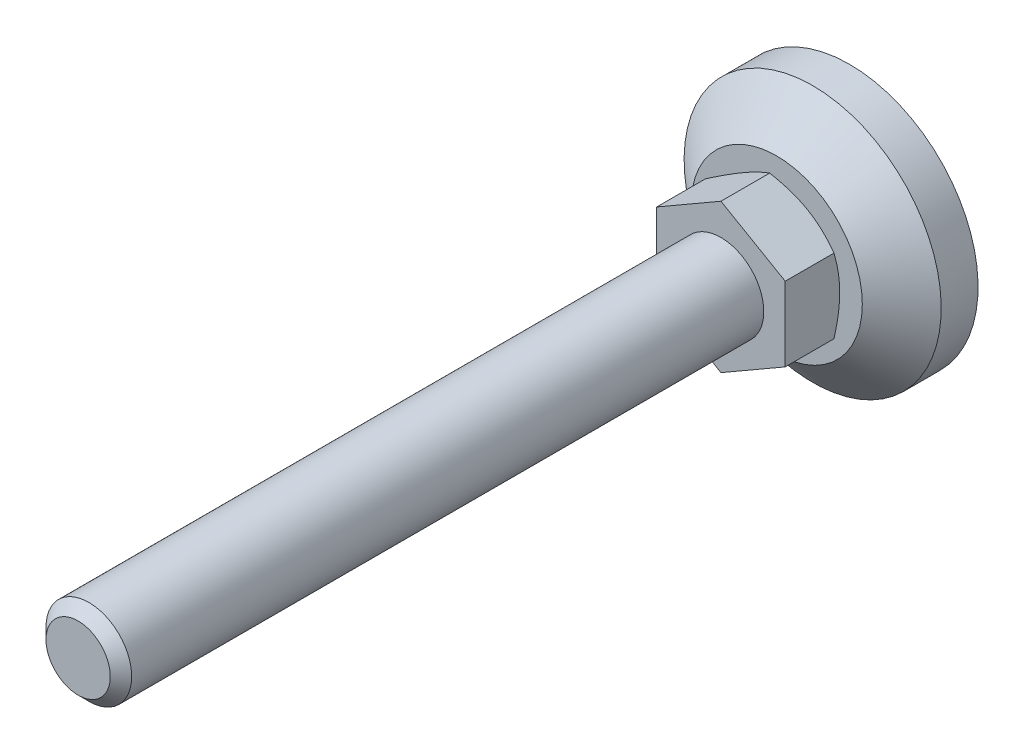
ISO-10303-21;
HEADER;
FILE_DESCRIPTION(('STEP AP214'),'2;1');
FILE_NAME('part.step','',(''),(''),'','','');
FILE_SCHEMA(('AUTOMOTIVE_DESIGN { 1 0 10303 214 1 1 1 1 }'));
ENDSEC;
DATA;
#1=APPLICATION_CONTEXT('core data for automotive mechanical design processes');
#2=APPLICATION_PROTOCOL_DEFINITION('international standard','automotive_design',2000,#1);
#3=PRODUCT_CONTEXT('',#1,'mechanical');
#4=PRODUCT('Part','Part','',(#3));
#5=PRODUCT_RELATED_PRODUCT_CATEGORY('part','',(#4));
#6=PRODUCT_DEFINITION_FORMATION('','',#4);
#7=PRODUCT_DEFINITION_CONTEXT('part definition',#1,'design');
#8=PRODUCT_DEFINITION('design','',#6,#7);
#9=PRODUCT_DEFINITION_SHAPE('','',#8);
#10=(LENGTH_UNIT() NAMED_UNIT(*) SI_UNIT(.MILLI.,.METRE.));
#11=(NAMED_UNIT(*) PLANE_ANGLE_UNIT() SI_UNIT($,.RADIAN.));
#12=(NAMED_UNIT(*) SI_UNIT($,.STERADIAN.) SOLID_ANGLE_UNIT());
#13=UNCERTAINTY_MEASURE_WITH_UNIT(LENGTH_MEASURE(1.E-05),#10,'distance_accuracy_value','');
#14=(GEOMETRIC_REPRESENTATION_CONTEXT(3) GLOBAL_UNCERTAINTY_ASSIGNED_CONTEXT((#13)) GLOBAL_UNIT_ASSIGNED_CONTEXT((#10,
#11,#12)) REPRESENTATION_CONTEXT('',''));
#15=CARTESIAN_POINT('',(0.,0.,0.));
#16=DIRECTION('',(0.,0.,1.));
#17=DIRECTION('',(1.,0.,0.));
#18=AXIS2_PLACEMENT_3D('',#15,#16,#17);
#19=CARTESIAN_POINT('',(0.,0.,30.));
#20=DIRECTION('',(0.,0.,1.));
#21=DIRECTION('',(0.5,-0.86602540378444,0.));
#22=AXIS2_PLACEMENT_3D('',#19,#20,#21);
#23=PLANE('',#22);
#24=DIRECTION('',(0.,1.,0.));
#25=VECTOR('',#24,1.);
#26=CARTESIAN_POINT('',(15.,-8.66025403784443,30.));
#27=LINE('',#26,#25);
#28=CARTESIAN_POINT('',(15.,-8.66025403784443,30.));
#29=VERTEX_POINT('',#28);
#30=CARTESIAN_POINT('',(15.,8.66025403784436,30.));
#31=VERTEX_POINT('',#30);
#32=EDGE_CURVE('E197',#29,#31,#27,.T.);
#33=ORIENTED_EDGE('',*,*,#32,.T.);
#34=DIRECTION('',(-0.866025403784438,0.5,0.));
#35=VECTOR('',#34,1.);
#36=CARTESIAN_POINT('',(15.,8.66025403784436,30.));
#37=LINE('',#36,#35);
#38=CARTESIAN_POINT('',(0.,17.3205080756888,30.));
#39=VERTEX_POINT('',#38);
#40=EDGE_CURVE('E320',#31,#39,#37,.T.);
#41=ORIENTED_EDGE('',*,*,#40,.T.);
#42=DIRECTION('',(-0.86602540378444,-0.5,0.));
#43=VECTOR('',#42,1.);
#44=CARTESIAN_POINT('',(0.,17.3205080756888,30.));
#45=LINE('',#44,#43);
#46=CARTESIAN_POINT('',(-15.,8.66025403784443,30.));
#47=VERTEX_POINT('',#46);
#48=EDGE_CURVE('E319',#39,#47,#45,.T.);
#49=ORIENTED_EDGE('',*,*,#48,.T.);
#50=DIRECTION('',(0.,-1.,0.));
#51=VECTOR('',#50,1.);
#52=CARTESIAN_POINT('',(-15.,8.66025403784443,30.));
#53=LINE('',#52,#51);
#54=CARTESIAN_POINT('',(-15.,-8.66025403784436,30.));
#55=VERTEX_POINT('',#54);
#56=EDGE_CURVE('E324',#47,#55,#53,.T.);
#57=ORIENTED_EDGE('',*,*,#56,.T.);
#58=DIRECTION('',(0.866025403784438,-0.5,0.));
#59=VECTOR('',#58,1.);
#60=CARTESIAN_POINT('',(-15.,-8.66025403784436,30.));
#61=LINE('',#60,#59);
#62=CARTESIAN_POINT('',(0.,-17.3205080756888,30.));
#63=VERTEX_POINT('',#62);
#64=EDGE_CURVE('E326',#55,#63,#61,.T.);
#65=ORIENTED_EDGE('',*,*,#64,.T.);
#66=DIRECTION('',(0.86602540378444,0.5,0.));
#67=VECTOR('',#66,1.);
#68=CARTESIAN_POINT('',(0.,-17.3205080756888,30.));
#69=LINE('',#68,#67);
#70=EDGE_CURVE('E37',#63,#29,#69,.T.);
#71=ORIENTED_EDGE('',*,*,#70,.T.);
#72=EDGE_LOOP('',(#33,#41,#49,#57,#65,#71));
#73=FACE_BOUND('',#72,.T.);
#74=CARTESIAN_POINT('',(0.,0.,30.));
#75=DIRECTION('',(0.,0.,1.));
#76=DIRECTION('',(0.5,-0.86602540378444,0.));
#77=AXIS2_PLACEMENT_3D('',#74,#75,#76);
#78=CIRCLE('',#77,10.);
#79=CARTESIAN_POINT('',(5.,-8.6602540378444,30.));
#80=VERTEX_POINT('',#79);
#81=EDGE_CURVE('E201',#80,#80,#78,.T.);
#82=ORIENTED_EDGE('',*,*,#81,.F.);
#83=EDGE_LOOP('',(#82));
#84=FACE_BOUND('',#83,.T.);
#85=ADVANCED_FACE('F14',(#73,#84),#23,.T.);
#86=CARTESIAN_POINT('',(-9.9946349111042,17.3112154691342,17.));
#87=DIRECTION('',(0.,0.,1.));
#88=DIRECTION('',(0.5,-0.86602540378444,0.));
#89=AXIS2_PLACEMENT_3D('',#86,#87,#88);
#90=PLANE('',#89);
#91=CARTESIAN_POINT('',(0.,0.,17.));
#92=DIRECTION('',(0.,0.,-1.));
#93=DIRECTION('',(-0.5,0.86602540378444,0.));
#94=AXIS2_PLACEMENT_3D('',#91,#92,#93);
#95=CIRCLE('',#94,19.9892698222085);
#96=CARTESIAN_POINT('',(-9.99463491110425,17.3112154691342,17.));
#97=VERTEX_POINT('',#96);
#98=EDGE_CURVE('E102',#97,#97,#95,.T.);
#99=ORIENTED_EDGE('',*,*,#98,.F.);
#100=EDGE_LOOP('',(#99));
#101=FACE_BOUND('',#100,.T.);
#102=CARTESIAN_POINT('',(0.,0.,17.));
#103=DIRECTION('',(0.,0.,-1.));
#104=DIRECTION('',(-0.5,0.86602540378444,0.));
#105=AXIS2_PLACEMENT_3D('',#102,#103,#104);
#106=CIRCLE('',#105,14.5);
#107=CARTESIAN_POINT('',(-7.25,12.5573683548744,17.));
#108=VERTEX_POINT('',#107);
#109=EDGE_CURVE('E84',#108,#108,#106,.T.);
#110=ORIENTED_EDGE('',*,*,#109,.T.);
#111=EDGE_LOOP('',(#110));
#112=FACE_BOUND('',#111,.T.);
#113=ADVANCED_FACE('F174',(#101,#112),#90,.T.);
#114=CARTESIAN_POINT('',(0.,0.,0.));
#115=DIRECTION('',(0.,0.,-1.));
#116=DIRECTION('',(-0.5,0.86602540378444,0.));
#117=AXIS2_PLACEMENT_3D('',#114,#115,#116);
#118=PLANE('',#117);
#119=CARTESIAN_POINT('',(0.,0.,0.));
#120=DIRECTION('',(0.,0.,-1.));
#121=DIRECTION('',(-0.5,0.86602540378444,0.));
#122=AXIS2_PLACEMENT_3D('',#119,#120,#121);
#123=CIRCLE('',#122,30.);
#124=CARTESIAN_POINT('',(-15.,25.9807621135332,0.));
#125=VERTEX_POINT('',#124);
#126=EDGE_CURVE('E73',#125,#125,#123,.T.);
#127=ORIENTED_EDGE('',*,*,#126,.T.);
#128=EDGE_LOOP('',(#127));
#129=FACE_BOUND('',#128,.T.);
#130=ADVANCED_FACE('F177',(#129),#118,.T.);
#131=CARTESIAN_POINT('',(0.,0.,-75.4972525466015));
#132=DIRECTION('',(0.,0.,-1.));
#133=DIRECTION('',(-0.5,0.86602540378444,0.));
#134=AXIS2_PLACEMENT_3D('',#131,#132,#133);
#135=CYLINDRICAL_SURFACE('',#134,30.);
#136=CARTESIAN_POINT('',(0.,0.,8.6));
#137=DIRECTION('',(0.,0.,-1.));
#138=DIRECTION('',(-0.5,0.86602540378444,0.));
#139=AXIS2_PLACEMENT_3D('',#136,#137,#138);
#140=CIRCLE('',#139,30.);
#141=CARTESIAN_POINT('',(-15.,25.9807621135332,8.6));
#142=VERTEX_POINT('',#141);
#143=EDGE_CURVE('E105',#142,#142,#140,.T.);
#144=ORIENTED_EDGE('',*,*,#143,.T.);
#145=EDGE_LOOP('',(#144));
#146=FACE_BOUND('',#145,.T.);
#147=ORIENTED_EDGE('',*,*,#126,.F.);
#148=EDGE_LOOP('',(#147));
#149=FACE_BOUND('',#148,.T.);
#150=ADVANCED_FACE('F181',(#146,#149),#135,.T.);
#151=CARTESIAN_POINT('',(0.,0.,8.6));
#152=DIRECTION('',(0.,0.,-1.));
#153=DIRECTION('',(-0.5,0.86602540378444,0.));
#154=AXIS2_PLACEMENT_3D('',#151,#152,#153);
#155=CONICAL_SURFACE('',#154,30.,0.872664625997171);
#156=ORIENTED_EDGE('',*,*,#98,.T.);
#157=EDGE_LOOP('',(#156));
#158=FACE_BOUND('',#157,.T.);
#159=ORIENTED_EDGE('',*,*,#143,.F.);
#160=EDGE_LOOP('',(#159));
#161=FACE_BOUND('',#160,.T.);
#162=ADVANCED_FACE('F121',(#158,#161),#155,.T.);
#163=CARTESIAN_POINT('',(0.,0.,22.6717337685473));
#164=DIRECTION('',(0.,0.,1.));
#165=DIRECTION('',(0.5,-0.86602540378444,0.));
#166=AXIS2_PLACEMENT_3D('',#163,#164,#165);
#167=CONICAL_SURFACE('',#166,24.3237310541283,1.0471975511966);
#168=ORIENTED_EDGE('',*,*,#109,.F.);
#169=EDGE_LOOP('',(#168));
#170=FACE_BOUND('',#169,.T.);
#171=CARTESIAN_POINT('',(-12.8456594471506,-24.7369530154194,24.7211504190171));
#172=CARTESIAN_POINT('',(-12.5611280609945,-24.5726787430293,24.5612751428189));
#173=CARTESIAN_POINT('',(-12.2762681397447,-24.4082147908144,24.4021798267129));
#174=CARTESIAN_POINT('',(-11.7058227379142,-24.0788679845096,24.0857253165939));
#175=CARTESIAN_POINT('',(-11.4202372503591,-23.913985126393,23.9283661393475));
#176=CARTESIAN_POINT('',(-10.5622163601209,-23.4186065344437,23.4591171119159));
#177=CARTESIAN_POINT('',(-9.98859766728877,-23.0874276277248,23.1501014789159));
#178=CARTESIAN_POINT('',(-8.83456075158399,-22.4211441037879,22.5399454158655));
#179=CARTESIAN_POINT('',(-8.25412262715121,-22.0860279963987,22.2388550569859));
#180=CARTESIAN_POINT('',(-7.08869976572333,-21.4131707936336,21.6486868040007));
#181=CARTESIAN_POINT('',(-6.50371523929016,-21.0754298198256,21.3596083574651));
#182=CARTESIAN_POINT('',(-5.30863673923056,-20.3854509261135,20.7872320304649));
#183=CARTESIAN_POINT('',(-4.69835665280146,-20.0331055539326,20.5044496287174));
#184=CARTESIAN_POINT('',(-3.47072651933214,-19.3243329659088,19.9597325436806));
#185=CARTESIAN_POINT('',(-2.85337569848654,-18.9679053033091,19.6978001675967));
#186=CARTESIAN_POINT('',(-1.61173392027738,-18.251043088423,19.2014950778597));
#187=CARTESIAN_POINT('',(-0.987459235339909,-17.8906179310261,18.9670685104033));
#188=CARTESIAN_POINT('',(0.270101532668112,-17.1645648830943,18.533130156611));
#189=CARTESIAN_POINT('',(0.903384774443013,-16.7989386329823,18.3336076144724));
#190=CARTESIAN_POINT('',(1.85843143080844,-16.2475421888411,18.0681549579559));
#191=CARTESIAN_POINT('',(2.17672728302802,-16.0637739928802,17.9854955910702));
#192=CARTESIAN_POINT('',(2.8155301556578,-15.6949609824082,17.8324159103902));
#193=CARTESIAN_POINT('',(3.13603713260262,-15.509916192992,17.761995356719));
#194=CARTESIAN_POINT('',(3.77905622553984,-15.1386689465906,17.6346216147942));
#195=CARTESIAN_POINT('',(4.1015683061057,-14.952466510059,17.5776681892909));
#196=CARTESIAN_POINT('',(4.7482706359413,-14.5790927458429,17.4783560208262));
#197=CARTESIAN_POINT('',(5.07246081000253,-14.39192146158,17.4359966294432));
#198=CARTESIAN_POINT('',(5.7177482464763,-14.0193645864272,17.3672579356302));
#199=CARTESIAN_POINT('',(6.03882895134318,-13.8339885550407,17.3406726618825));
#200=CARTESIAN_POINT('',(6.68167638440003,-13.4628404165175,17.3032157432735));
#201=CARTESIAN_POINT('',(7.0034431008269,-13.2770683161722,17.2923438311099));
#202=CARTESIAN_POINT('',(7.64708696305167,-12.9054603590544,17.2865732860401));
#203=CARTESIAN_POINT('',(7.96896410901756,-12.719624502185,17.291674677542));
#204=CARTESIAN_POINT('',(8.6122410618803,-12.3482283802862,17.31772364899));
#205=CARTESIAN_POINT('',(8.93364084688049,-12.1626681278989,17.3386719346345));
#206=CARTESIAN_POINT('',(9.70006843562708,-11.7201709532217,17.4070708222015));
#207=CARTESIAN_POINT('',(10.1446275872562,-11.4635046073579,17.4616548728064));
#208=CARTESIAN_POINT('',(11.0305797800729,-10.9519998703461,17.598223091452));
#209=CARTESIAN_POINT('',(11.4719724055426,-10.6971617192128,17.6802107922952));
#210=CARTESIAN_POINT('',(12.3511241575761,-10.1895832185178,17.8686701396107));
#211=CARTESIAN_POINT('',(12.7888803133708,-9.93684458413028,17.9751600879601));
#212=CARTESIAN_POINT('',(13.6600677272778,-9.43386429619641,18.2093621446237));
#213=CARTESIAN_POINT('',(14.093499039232,-9.18362261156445,18.3370739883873));
#214=CARTESIAN_POINT('',(14.9657613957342,-8.68002170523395,18.6136784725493));
#215=CARTESIAN_POINT('',(15.4044935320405,-8.42671958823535,18.7629840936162));
#216=CARTESIAN_POINT('',(16.2776387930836,-7.92260893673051,19.0774927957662));
#217=CARTESIAN_POINT('',(16.7120518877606,-7.67180041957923,19.2426959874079));
#218=CARTESIAN_POINT('',(17.5767675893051,-7.17255657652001,19.5863356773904));
#219=CARTESIAN_POINT('',(18.0070714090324,-6.92412055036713,19.7647681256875));
#220=CARTESIAN_POINT('',(18.8640855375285,-6.42932321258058,20.1327209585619));
#221=CARTESIAN_POINT('',(19.2907959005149,-6.18296186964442,20.3222411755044));
#222=CARTESIAN_POINT('',(20.3428317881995,-5.57556866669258,20.8026992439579));
#223=CARTESIAN_POINT('',(20.9662920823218,-5.21561369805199,21.0990762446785));
#224=CARTESIAN_POINT('',(22.2075096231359,-4.49899641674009,21.7073961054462));
#225=CARTESIAN_POINT('',(22.8252664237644,-4.14233436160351,22.0193401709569));
#226=CARTESIAN_POINT('',(24.0562171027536,-3.43164465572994,22.6554928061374));
#227=CARTESIAN_POINT('',(24.6694096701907,-3.07761776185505,22.9797047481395));
#228=CARTESIAN_POINT('',(25.8918722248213,-2.37182867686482,23.6377669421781));
#229=CARTESIAN_POINT('',(26.5011423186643,-2.02006642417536,23.9716169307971));
#230=CARTESIAN_POINT('',(27.717227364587,-1.31795939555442,24.6474851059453));
#231=CARTESIAN_POINT('',(28.3240381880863,-0.967617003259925,24.9895131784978));
#232=CARTESIAN_POINT('',(29.5349682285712,-0.268486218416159,25.6798644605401));
#233=CARTESIAN_POINT('',(30.1390874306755,0.0803021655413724,26.0281877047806));
#234=CARTESIAN_POINT('',(31.3449758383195,0.776522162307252,26.7299417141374));
#235=CARTESIAN_POINT('',(31.9467453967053,1.12395397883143,27.0833716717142));
#236=CARTESIAN_POINT('',(33.1483798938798,1.81771797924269,27.7945141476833));
#237=CARTESIAN_POINT('',(33.7482448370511,2.16405016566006,28.1522266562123));
#238=CARTESIAN_POINT('',(35.4362393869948,3.13861427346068,29.1651922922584));
#239=CARTESIAN_POINT('',(36.5225182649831,3.76577767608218,29.8245570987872));
#240=CARTESIAN_POINT('',(38.6911220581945,5.01782165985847,31.1520110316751));
#241=CARTESIAN_POINT('',(39.7734467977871,5.64270213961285,31.8201005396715));
#242=CARTESIAN_POINT('',(41.9319563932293,6.88891823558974,33.1609996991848));
#243=CARTESIAN_POINT('',(43.0081499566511,7.51025887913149,33.8337906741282));
#244=CARTESIAN_POINT('',(44.620597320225,8.441205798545,34.8467910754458));
#245=CARTESIAN_POINT('',(45.1577559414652,8.75133447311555,35.1850829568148));
#246=CARTESIAN_POINT('',(46.2315316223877,9.37127915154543,35.8628086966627));
#247=CARTESIAN_POINT('',(46.7681486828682,9.68109515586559,36.2022425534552));
#248=CARTESIAN_POINT('',(47.3045265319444,9.99077305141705,36.5421798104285));
#249=B_SPLINE_CURVE_WITH_KNOTS('',3,(#171,#172,#173,#174,#175,#176,#177,#178,#179,#180,#181,
#182,#183,#184,#185,#186,#187,#188,#189,#190,#191,#192,#193,#194,#195,#196,#197,#198,#199,#200,
#201,#202,#203,#204,#205,#206,#207,#208,#209,#210,#211,#212,#213,#214,#215,#216,#217,#218,#219,
#220,#221,#222,#223,#224,#225,#226,#227,#228,#229,#230,#231,#232,#233,#234,#235,#236,#237,#238,
#239,#240,#241,#242,#243,#244,#245,#246,#247,#248),.UNSPECIFIED.,.F.,.F.,(4,2,2,2,2,2,2,2,2,2,2,
2,2,2,2,2,2,2,2,2,2,2,2,2,2,2,2,2,2,2,2,2,2,2,2,2,2,2,4),(0.,1.09614509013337,2.19230075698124,
4.38492481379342,6.5891013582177,8.79317641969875,11.0708608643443,13.3487970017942,
15.622195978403,17.894893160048,19.0248728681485,20.1548304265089,21.2847680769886,
22.4146555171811,23.5294447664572,24.6442150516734,25.7589870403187,26.8738086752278,
28.4216372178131,29.9696653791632,31.5188536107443,33.0680225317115,34.6521549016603,
36.236298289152,37.8199586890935,39.4035951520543,41.7389293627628,44.0744446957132,
46.4106067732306,48.7467050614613,51.0857864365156,53.4248807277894,55.7636090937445,
58.1023320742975,62.3535003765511,66.6048552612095,70.8441948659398,72.9637328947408,
75.083267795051),.UNSPECIFIED.);
#250=CARTESIAN_POINT('',(0.,-17.3205080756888,18.6284210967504));
#251=VERTEX_POINT('',#250);
#252=CARTESIAN_POINT('',(15.,-8.66025403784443,18.6284210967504));
#253=VERTEX_POINT('',#252);
#254=EDGE_CURVE('E65',#251,#253,#249,.T.);
#255=ORIENTED_EDGE('',*,*,#254,.F.);
#256=CARTESIAN_POINT('',(-15.0002,-8.66013856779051,18.6284877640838));
#257=CARTESIAN_POINT('',(-14.6705058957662,-8.85048754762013,18.5185969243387));
#258=CARTESIAN_POINT('',(-14.3395258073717,-9.0415789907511,18.4136927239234));
#259=CARTESIAN_POINT('',(-13.674911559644,-9.42529420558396,18.2152437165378));
#260=CARTESIAN_POINT('',(-13.3412765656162,-9.61791845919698,18.1217026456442));
#261=CARTESIAN_POINT('',(-12.6707077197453,-10.0050715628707,17.9472372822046));
#262=CARTESIAN_POINT('',(-12.333767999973,-10.1996038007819,17.8663428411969));
#263=CARTESIAN_POINT('',(-11.6575472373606,-10.5900200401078,17.7189077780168));
#264=CARTESIAN_POINT('',(-11.3182663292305,-10.7859039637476,17.6523663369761));
#265=CARTESIAN_POINT('',(-10.6460568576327,-11.1740042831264,17.5364675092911));
#266=CARTESIAN_POINT('',(-10.3131781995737,-11.3661918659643,17.4867265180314));
#267=CARTESIAN_POINT('',(-9.64589556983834,-11.7514476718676,17.4033218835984));
#268=CARTESIAN_POINT('',(-9.31149156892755,-11.9445159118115,17.3696585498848));
#269=CARTESIAN_POINT('',(-8.64212181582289,-12.3309767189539,17.3192592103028));
#270=CARTESIAN_POINT('',(-8.30715720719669,-12.5243686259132,17.3025030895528));
#271=CARTESIAN_POINT('',(-7.63691878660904,-12.9113309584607,17.2862785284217));
#272=CARTESIAN_POINT('',(-7.30164498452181,-13.104901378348,17.2868095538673));
#273=CARTESIAN_POINT('',(-6.67485311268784,-13.4667798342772,17.303951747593));
#274=CARTESIAN_POINT('',(-6.38329037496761,-13.6351136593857,17.3184719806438));
#275=CARTESIAN_POINT('',(-5.80083556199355,-13.971394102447,17.3603122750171));
#276=CARTESIAN_POINT('',(-5.50994353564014,-14.1393406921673,17.3876332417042));
#277=CARTESIAN_POINT('',(-4.9289881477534,-14.4747554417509,17.4545986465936));
#278=CARTESIAN_POINT('',(-4.63892567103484,-14.6422230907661,17.4942532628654));
#279=CARTESIAN_POINT('',(-4.06016058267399,-14.9763732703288,17.5851902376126));
#280=CARTESIAN_POINT('',(-3.77145806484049,-15.1430557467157,17.636473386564));
#281=CARTESIAN_POINT('',(-2.89508556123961,-15.6490296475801,17.8090619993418));
#282=CARTESIAN_POINT('',(-2.30995340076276,-15.9868558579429,17.9475763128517));
#283=CARTESIAN_POINT('',(-1.14841408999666,-16.657470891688,18.26194710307));
#284=CARTESIAN_POINT('',(-0.571992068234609,-16.9902683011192,18.4377297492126));
#285=CARTESIAN_POINT('',(0.000199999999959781,-17.3206235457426,18.6284877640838));
#286=B_SPLINE_CURVE_WITH_KNOTS('',3,(#256,#257,#258,#259,#260,#261,#262,#263,#264,#265,#266,
#267,#268,#269,#270,#271,#272,#273,#274,#275,#276,#277,#278,#279,#280,#281,#282,#283,#284,#285),
.UNSPECIFIED.,.F.,.F.,(4,2,2,2,2,2,2,2,2,2,2,2,2,2,4),(0.,1.18875411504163,2.37789802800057,
3.56980778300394,4.76164951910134,5.92407379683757,7.08652044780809,8.24758247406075,
9.40860862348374,10.4193068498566,11.4300765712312,12.4416826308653,13.4533574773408,
15.5211962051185,17.5849760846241),.UNSPECIFIED.);
#287=CARTESIAN_POINT('',(-15.,-8.66025403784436,18.6284210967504));
#288=VERTEX_POINT('',#287);
#289=EDGE_CURVE('E68',#288,#251,#286,.T.);
#290=ORIENTED_EDGE('',*,*,#289,.F.);
#291=CARTESIAN_POINT('',(-15.,8.66048497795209,18.6284877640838));
#292=CARTESIAN_POINT('',(-15.,8.27978701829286,18.5185969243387));
#293=CARTESIAN_POINT('',(-15.,7.89760413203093,18.4136927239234));
#294=CARTESIAN_POINT('',(-15.,7.13017370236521,18.2152437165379));
#295=CARTESIAN_POINT('',(-15.,6.74492519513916,18.1217026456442));
#296=CARTESIAN_POINT('',(-15.,5.97061898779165,17.9472372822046));
#297=CARTESIAN_POINT('',(-15.,5.58155451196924,17.8663428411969));
#298=CARTESIAN_POINT('',(-15.,4.80072203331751,17.7189077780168));
#299=CARTESIAN_POINT('',(-15.,4.40895418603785,17.6523663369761));
#300=CARTESIAN_POINT('',(-15.,3.63275354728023,17.5364675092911));
#301=CARTESIAN_POINT('',(-15.,3.24837838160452,17.4867265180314));
#302=CARTESIAN_POINT('',(-15.,2.47786676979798,17.4033218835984));
#303=CARTESIAN_POINT('',(-15.,2.0917302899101,17.3696585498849));
#304=CARTESIAN_POINT('',(-15.,1.31880867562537,17.3192592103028));
#305=CARTESIAN_POINT('',(-15.,0.932024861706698,17.3025030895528));
#306=CARTESIAN_POINT('',(-15.,0.158100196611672,17.2862785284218));
#307=CARTESIAN_POINT('',(-15.,-0.229040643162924,17.2868095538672));
#308=CARTESIAN_POINT('',(-15.,-0.952797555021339,17.303951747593));
#309=CARTESIAN_POINT('',(-15.,-1.28946520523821,17.3184719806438));
#310=CARTESIAN_POINT('',(-15.,-1.96202609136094,17.3603122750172));
#311=CARTESIAN_POINT('',(-15.,-2.29791927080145,17.3876332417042));
#312=CARTESIAN_POINT('',(-15.,-2.96874876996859,17.4545986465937));
#313=CARTESIAN_POINT('',(-15.,-3.30368406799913,17.4942532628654));
#314=CARTESIAN_POINT('',(-15.,-3.97198442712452,17.5851902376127));
#315=CARTESIAN_POINT('',(-15.,-4.3053493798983,17.636473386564));
#316=CARTESIAN_POINT('',(-15.,-5.317297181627,17.8090619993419));
#317=CARTESIAN_POINT('',(-15.,-5.99294960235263,17.9475763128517));
#318=CARTESIAN_POINT('',(-15.,-7.33417966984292,18.26194710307));
#319=CARTESIAN_POINT('',(-15.,-7.99977448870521,18.4377297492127));
#320=CARTESIAN_POINT('',(-15.,-8.66048497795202,18.6284877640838));
#321=B_SPLINE_CURVE_WITH_KNOTS('',3,(#291,#292,#293,#294,#295,#296,#297,#298,#299,#300,#301,
#302,#303,#304,#305,#306,#307,#308,#309,#310,#311,#312,#313,#314,#315,#316,#317,#318,#319,#320),
.UNSPECIFIED.,.F.,.F.,(4,2,2,2,2,2,2,2,2,2,2,2,2,2,4),(0.,1.18875411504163,2.37789802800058,
3.56980778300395,4.76164951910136,5.92407379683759,7.08652044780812,8.24758247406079,
9.40860862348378,10.4193068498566,11.4300765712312,12.4416826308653,13.4533574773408,
15.5211962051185,17.5849760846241),.UNSPECIFIED.);
#322=CARTESIAN_POINT('',(-15.,8.66025403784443,18.6284210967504));
#323=VERTEX_POINT('',#322);
#324=EDGE_CURVE('E83',#323,#288,#321,.T.);
#325=ORIENTED_EDGE('',*,*,#324,.F.);
#326=CARTESIAN_POINT('',(-27.8456594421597,1.24380910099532,24.7211504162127));
#327=CARTESIAN_POINT('',(-27.5611280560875,1.40808337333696,24.561275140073));
#328=CARTESIAN_POINT('',(-27.2762681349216,1.5725473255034,24.4021798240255));
#329=CARTESIAN_POINT('',(-26.7058227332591,1.90189413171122,24.0857253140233));
#330=CARTESIAN_POINT('',(-26.4202372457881,2.06677698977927,23.9283661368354));
#331=CARTESIAN_POINT('',(-25.5622163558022,2.56215558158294,23.4591171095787));
#332=CARTESIAN_POINT('',(-24.9885976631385,2.89333448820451,23.150101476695));
#333=CARTESIAN_POINT('',(-23.8345607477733,3.55961801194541,22.5399454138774));
#334=CARTESIAN_POINT('',(-23.2541226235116,3.89473411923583,22.2388550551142));
#335=CARTESIAN_POINT('',(-22.088699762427,4.56759132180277,21.64868680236));
#336=CARTESIAN_POINT('',(-21.503715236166,4.9053322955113,21.3596083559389));
#337=CARTESIAN_POINT('',(-20.3086367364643,5.59531118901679,20.787232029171));
#338=CARTESIAN_POINT('',(-19.698356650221,5.94765656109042,20.5044496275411));
#339=CARTESIAN_POINT('',(-18.4707265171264,6.65642914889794,19.9597325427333));
#340=CARTESIAN_POINT('',(-17.8533756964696,7.01285681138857,19.6978001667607));
#341=CARTESIAN_POINT('',(-16.6117339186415,7.72971902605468,19.2014950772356));
#342=CARTESIAN_POINT('',(-15.9874592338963,8.09014418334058,18.96706850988));
#343=CARTESIAN_POINT('',(-14.7298984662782,8.81619723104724,18.5331301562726));
#344=CARTESIAN_POINT('',(-14.0966152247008,9.1818234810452,18.3336076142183));
#345=CARTESIAN_POINT('',(-13.1415685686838,9.73321992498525,18.0681549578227));
#346=CARTESIAN_POINT('',(-12.8232727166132,9.91698812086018,17.9854955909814));
#347=CARTESIAN_POINT('',(-12.1844698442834,10.2858011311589,17.8324159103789));
#348=CARTESIAN_POINT('',(-11.8639628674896,10.4708459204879,17.7619953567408));
#349=CARTESIAN_POINT('',(-11.2209437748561,10.8420931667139,17.6346216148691));
#350=CARTESIAN_POINT('',(-10.898431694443,11.0282956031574,17.5776681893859));
#351=CARTESIAN_POINT('',(-10.2517293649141,11.4016693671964,17.4783560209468));
#352=CARTESIAN_POINT('',(-9.92753919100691,11.5888406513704,17.4359966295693));
#353=CARTESIAN_POINT('',(-9.28225175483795,11.9613975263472,17.3672579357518));
#354=CARTESIAN_POINT('',(-8.96117105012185,12.1467735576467,17.3406726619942));
#355=CARTESIAN_POINT('',(-8.31832361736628,12.5179216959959,17.30321574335));
#356=CARTESIAN_POINT('',(-7.9965569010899,12.7036937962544,17.2923438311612));
#357=CARTESIAN_POINT('',(-7.352913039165,13.075301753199,17.2865732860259));
#358=CARTESIAN_POINT('',(-7.03103589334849,13.2611376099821,17.2916746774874));
#359=CARTESIAN_POINT('',(-6.38775894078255,13.6325337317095,17.3177236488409));
#360=CARTESIAN_POINT('',(-6.06635915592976,13.8180939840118,17.3386719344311));
#361=CARTESIAN_POINT('',(-5.29993156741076,14.2605911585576,17.4070708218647));
#362=CARTESIAN_POINT('',(-4.85537241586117,14.5172575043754,17.4616548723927));
#363=CARTESIAN_POINT('',(-3.96942022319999,15.0287622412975,17.5982230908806));
#364=CARTESIAN_POINT('',(-3.52802759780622,15.2836003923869,17.6802107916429));
#365=CARTESIAN_POINT('',(-2.64887584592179,15.7911788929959,17.8686701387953));
#366=CARTESIAN_POINT('',(-2.21111969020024,16.0439175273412,17.9751600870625));
#367=CARTESIAN_POINT('',(-1.33993227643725,16.5468978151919,18.2093621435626));
#368=CARTESIAN_POINT('',(-0.906500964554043,16.7971394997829,18.3370739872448));
#369=CARTESIAN_POINT('',(-0.0342386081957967,17.3007404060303,18.6136784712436));
#370=CARTESIAN_POINT('',(0.404493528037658,17.5540425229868,18.7629840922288));
#371=CARTESIAN_POINT('',(1.27763878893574,18.0581531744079,19.0774927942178));
#372=CARTESIAN_POINT('',(1.71205188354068,18.3089616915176,19.2426959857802));
#373=CARTESIAN_POINT('',(2.57676758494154,18.8082055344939,19.586335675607));
#374=CARTESIAN_POINT('',(3.00707140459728,19.0566415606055,19.7647681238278));
#375=CARTESIAN_POINT('',(3.86408553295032,19.5514388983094,20.1327209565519));
#376=CARTESIAN_POINT('',(4.29079589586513,19.7978002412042,20.3222411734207));
#377=CARTESIAN_POINT('',(5.34283178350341,20.4051934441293,20.8026992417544));
#378=CARTESIAN_POINT('',(5.9662920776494,20.7651484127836,21.0990762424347));
#379=CARTESIAN_POINT('',(7.20750961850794,21.4817656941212,21.707396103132));
#380=CARTESIAN_POINT('',(7.82526641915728,21.8384277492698,22.0193401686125));
#381=CARTESIAN_POINT('',(9.05621709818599,22.5491174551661,22.6554928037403));
#382=CARTESIAN_POINT('',(9.66940966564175,22.9031443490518,22.97970474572));
#383=CARTESIAN_POINT('',(10.8918722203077,23.6089334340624,23.6377669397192));
#384=CARTESIAN_POINT('',(11.5011423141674,23.9606956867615,23.9716169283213));
#385=CARTESIAN_POINT('',(12.7172273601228,24.6628027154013,24.6474851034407));
#386=CARTESIAN_POINT('',(13.3240381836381,25.0131451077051,24.9895131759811));
#387=CARTESIAN_POINT('',(14.5349682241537,25.7122758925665,25.6798644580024));
#388=CARTESIAN_POINT('',(15.1390874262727,26.0610642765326,26.0281877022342));
#389=CARTESIAN_POINT('',(16.3449758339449,26.7572842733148,26.7299417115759));
#390=CARTESIAN_POINT('',(16.9467453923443,27.1047160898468,27.0833716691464));
#391=CARTESIAN_POINT('',(18.1483798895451,27.7984800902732,27.7945141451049));
#392=CARTESIAN_POINT('',(18.7482448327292,28.144812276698,28.1522266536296));
#393=CARTESIAN_POINT('',(20.4362393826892,29.119376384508,29.1651922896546));
#394=CARTESIAN_POINT('',(21.5225182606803,29.7465397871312,29.8245570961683));
#395=CARTESIAN_POINT('',(23.6911220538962,30.99858377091,31.1520110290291));
#396=CARTESIAN_POINT('',(24.7734467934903,31.6234642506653,31.8201005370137));
#397=CARTESIAN_POINT('',(26.9319563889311,32.8696803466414,33.1609996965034));
#398=CARTESIAN_POINT('',(28.0081499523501,33.4910209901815,33.833790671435));
#399=CARTESIAN_POINT('',(29.6205973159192,34.4219679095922,34.8467910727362));
#400=CARTESIAN_POINT('',(30.1577559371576,34.7320965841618,35.1850829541));
#401=CARTESIAN_POINT('',(31.2315316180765,35.3520412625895,35.8628086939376));
#402=CARTESIAN_POINT('',(31.7681486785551,35.6618572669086,36.2022425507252));
#403=CARTESIAN_POINT('',(32.3045265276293,35.9715351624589,36.5421798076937));
#404=B_SPLINE_CURVE_WITH_KNOTS('',3,(#326,#327,#328,#329,#330,#331,#332,#333,#334,#335,#336,
#337,#338,#339,#340,#341,#342,#343,#344,#345,#346,#347,#348,#349,#350,#351,#352,#353,#354,#355,
#356,#357,#358,#359,#360,#361,#362,#363,#364,#365,#366,#367,#368,#369,#370,#371,#372,#373,#374,
#375,#376,#377,#378,#379,#380,#381,#382,#383,#384,#385,#386,#387,#388,#389,#390,#391,#392,#393,
#394,#395,#396,#397,#398,#399,#400,#401,#402,#403),.UNSPECIFIED.,.F.,.F.,(4,2,2,2,2,2,2,2,2,2,2,
2,2,2,2,2,2,2,2,2,2,2,2,2,2,2,2,2,2,2,2,2,2,2,2,2,2,2,4),(0.,1.09614508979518,2.19230075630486,
4.38492481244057,6.5891013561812,8.79317641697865,11.0708608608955,13.3487969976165,
15.6221959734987,17.8948931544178,19.024872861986,20.1548304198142,21.2847680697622,
22.4146555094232,23.5294447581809,24.6442150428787,25.7589870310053,26.8738086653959,
28.421637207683,29.9696653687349,31.5188536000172,33.0680225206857,34.6521548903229,
36.2362982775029,37.8199586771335,39.4035951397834,41.7389293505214,44.0744446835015,
46.4106067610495,48.7467050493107,51.0857864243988,53.4248807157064,55.7636090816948,
58.1023320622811,62.3535003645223,66.6048552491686,70.8441948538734,72.9637328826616,
75.0832677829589),.UNSPECIFIED.);
#405=CARTESIAN_POINT('',(0.,17.3205080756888,18.6284210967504));
#406=VERTEX_POINT('',#405);
#407=EDGE_CURVE('E143',#406,#323,#404,.F.);
#408=ORIENTED_EDGE('',*,*,#407,.F.);
#409=CARTESIAN_POINT('',(15.0002,8.66013856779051,18.6284877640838));
#410=CARTESIAN_POINT('',(14.6705058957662,8.85048754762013,18.5185969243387));
#411=CARTESIAN_POINT('',(14.3395258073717,9.0415789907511,18.4136927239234));
#412=CARTESIAN_POINT('',(13.674911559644,9.42529420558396,18.2152437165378));
#413=CARTESIAN_POINT('',(13.3412765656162,9.61791845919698,18.1217026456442));
#414=CARTESIAN_POINT('',(12.6707077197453,10.0050715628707,17.9472372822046));
#415=CARTESIAN_POINT('',(12.333767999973,10.1996038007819,17.8663428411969));
#416=CARTESIAN_POINT('',(11.6575472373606,10.5900200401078,17.7189077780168));
#417=CARTESIAN_POINT('',(11.3182663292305,10.7859039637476,17.6523663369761));
#418=CARTESIAN_POINT('',(10.6460568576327,11.1740042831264,17.5364675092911));
#419=CARTESIAN_POINT('',(10.3131781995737,11.3661918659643,17.4867265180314));
#420=CARTESIAN_POINT('',(9.64589556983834,11.7514476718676,17.4033218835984));
#421=CARTESIAN_POINT('',(9.31149156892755,11.9445159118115,17.3696585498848));
#422=CARTESIAN_POINT('',(8.64212181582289,12.3309767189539,17.3192592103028));
#423=CARTESIAN_POINT('',(8.30715720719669,12.5243686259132,17.3025030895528));
#424=CARTESIAN_POINT('',(7.63691878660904,12.9113309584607,17.2862785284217));
#425=CARTESIAN_POINT('',(7.30164498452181,13.104901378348,17.2868095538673));
#426=CARTESIAN_POINT('',(6.67485311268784,13.4667798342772,17.303951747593));
#427=CARTESIAN_POINT('',(6.38329037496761,13.6351136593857,17.3184719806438));
#428=CARTESIAN_POINT('',(5.80083556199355,13.971394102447,17.3603122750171));
#429=CARTESIAN_POINT('',(5.50994353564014,14.1393406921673,17.3876332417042));
#430=CARTESIAN_POINT('',(4.9289881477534,14.4747554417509,17.4545986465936));
#431=CARTESIAN_POINT('',(4.63892567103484,14.6422230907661,17.4942532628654));
#432=CARTESIAN_POINT('',(4.06016058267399,14.9763732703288,17.5851902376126));
#433=CARTESIAN_POINT('',(3.77145806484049,15.1430557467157,17.636473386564));
#434=CARTESIAN_POINT('',(2.89508556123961,15.6490296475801,17.8090619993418));
#435=CARTESIAN_POINT('',(2.30995340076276,15.9868558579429,17.9475763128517));
#436=CARTESIAN_POINT('',(1.14841408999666,16.657470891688,18.26194710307));
#437=CARTESIAN_POINT('',(0.571992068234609,16.9902683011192,18.4377297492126));
#438=CARTESIAN_POINT('',(-0.000199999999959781,17.3206235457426,18.6284877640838));
#439=B_SPLINE_CURVE_WITH_KNOTS('',3,(#409,#410,#411,#412,#413,#414,#415,#416,#417,#418,#419,
#420,#421,#422,#423,#424,#425,#426,#427,#428,#429,#430,#431,#432,#433,#434,#435,#436,#437,#438),
.UNSPECIFIED.,.F.,.F.,(4,2,2,2,2,2,2,2,2,2,2,2,2,2,4),(0.,1.18875411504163,2.37789802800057,
3.56980778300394,4.76164951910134,5.92407379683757,7.08652044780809,8.24758247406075,
9.40860862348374,10.4193068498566,11.4300765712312,12.4416826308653,13.4533574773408,
15.5211962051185,17.5849760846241),.UNSPECIFIED.);
#440=CARTESIAN_POINT('',(15.,8.66025403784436,18.6284210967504));
#441=VERTEX_POINT('',#440);
#442=EDGE_CURVE('E150',#441,#406,#439,.T.);
#443=ORIENTED_EDGE('',*,*,#442,.F.);
#444=CARTESIAN_POINT('',(15.,-8.66048497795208,18.6284877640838));
#445=CARTESIAN_POINT('',(15.,-8.27978701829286,18.5185969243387));
#446=CARTESIAN_POINT('',(15.,-7.89760413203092,18.4136927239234));
#447=CARTESIAN_POINT('',(15.,-7.1301737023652,18.2152437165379));
#448=CARTESIAN_POINT('',(15.,-6.74492519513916,18.1217026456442));
#449=CARTESIAN_POINT('',(15.,-5.97061898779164,17.9472372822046));
#450=CARTESIAN_POINT('',(15.,-5.58155451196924,17.8663428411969));
#451=CARTESIAN_POINT('',(15.,-4.8007220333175,17.7189077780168));
#452=CARTESIAN_POINT('',(15.,-4.40895418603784,17.6523663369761));
#453=CARTESIAN_POINT('',(15.,-3.63275354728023,17.5364675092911));
#454=CARTESIAN_POINT('',(15.,-3.24837838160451,17.4867265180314));
#455=CARTESIAN_POINT('',(15.,-2.47786676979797,17.4033218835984));
#456=CARTESIAN_POINT('',(15.,-2.0917302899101,17.3696585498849));
#457=CARTESIAN_POINT('',(15.,-1.31880867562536,17.3192592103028));
#458=CARTESIAN_POINT('',(15.,-0.932024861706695,17.3025030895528));
#459=CARTESIAN_POINT('',(15.,-0.158100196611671,17.2862785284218));
#460=CARTESIAN_POINT('',(15.,0.229040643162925,17.2868095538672));
#461=CARTESIAN_POINT('',(15.,0.952797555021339,17.303951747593));
#462=CARTESIAN_POINT('',(15.,1.28946520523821,17.3184719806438));
#463=CARTESIAN_POINT('',(15.,1.96202609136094,17.3603122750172));
#464=CARTESIAN_POINT('',(15.,2.29791927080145,17.3876332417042));
#465=CARTESIAN_POINT('',(15.,2.96874876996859,17.4545986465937));
#466=CARTESIAN_POINT('',(15.,3.30368406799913,17.4942532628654));
#467=CARTESIAN_POINT('',(15.,3.97198442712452,17.5851902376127));
#468=CARTESIAN_POINT('',(15.,4.3053493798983,17.636473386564));
#469=CARTESIAN_POINT('',(15.,5.317297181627,17.8090619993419));
#470=CARTESIAN_POINT('',(15.,5.99294960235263,17.9475763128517));
#471=CARTESIAN_POINT('',(15.,7.33417966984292,18.26194710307));
#472=CARTESIAN_POINT('',(15.,7.99977448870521,18.4377297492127));
#473=CARTESIAN_POINT('',(15.,8.66048497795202,18.6284877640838));
#474=B_SPLINE_CURVE_WITH_KNOTS('',3,(#444,#445,#446,#447,#448,#449,#450,#451,#452,#453,#454,
#455,#456,#457,#458,#459,#460,#461,#462,#463,#464,#465,#466,#467,#468,#469,#470,#471,#472,#473),
.UNSPECIFIED.,.F.,.F.,(4,2,2,2,2,2,2,2,2,2,2,2,2,2,4),(0.,1.18875411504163,2.37789802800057,
3.56980778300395,4.76164951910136,5.92407379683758,7.08652044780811,8.24758247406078,
9.40860862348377,10.4193068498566,11.4300765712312,12.4416826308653,13.4533574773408,
15.5211962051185,17.5849760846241),.UNSPECIFIED.);
#475=EDGE_CURVE('E29',#253,#441,#474,.T.);
#476=ORIENTED_EDGE('',*,*,#475,.F.);
#477=EDGE_LOOP('',(#255,#290,#325,#408,#443,#476));
#478=FACE_BOUND('',#477,.T.);
#479=ADVANCED_FACE('F67',(#170,#478),#167,.T.);
#480=CARTESIAN_POINT('',(0.,-17.3205080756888,30.));
#481=DIRECTION('',(-0.5,0.86602540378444,0.));
#482=DIRECTION('',(-0.86602540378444,-0.5,0.));
#483=AXIS2_PLACEMENT_3D('',#480,#481,#482);
#484=PLANE('',#483);
#485=DIRECTION('',(0.,0.,-1.));
#486=VECTOR('',#485,1.);
#487=CARTESIAN_POINT('',(0.,-17.3205080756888,30.));
#488=LINE('',#487,#486);
#489=EDGE_CURVE('E80',#63,#251,#488,.T.);
#490=ORIENTED_EDGE('',*,*,#489,.T.);
#491=ORIENTED_EDGE('',*,*,#254,.T.);
#492=DIRECTION('',(0.,0.,-1.));
#493=VECTOR('',#492,1.);
#494=CARTESIAN_POINT('',(15.,-8.66025403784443,30.));
#495=LINE('',#494,#493);
#496=EDGE_CURVE('E87',#29,#253,#495,.T.);
#497=ORIENTED_EDGE('',*,*,#496,.F.);
#498=ORIENTED_EDGE('',*,*,#70,.F.);
#499=EDGE_LOOP('',(#490,#491,#497,#498));
#500=FACE_BOUND('',#499,.T.);
#501=ADVANCED_FACE('F86',(#500),#484,.F.);
#502=CARTESIAN_POINT('',(-15.,-8.66025403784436,30.));
#503=DIRECTION('',(0.5,0.866025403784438,0.));
#504=DIRECTION('',(-0.866025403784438,0.5,0.));
#505=AXIS2_PLACEMENT_3D('',#502,#503,#504);
#506=PLANE('',#505);
#507=DIRECTION('',(0.,0.,-1.));
#508=VECTOR('',#507,1.);
#509=CARTESIAN_POINT('',(-15.,-8.66025403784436,30.));
#510=LINE('',#509,#508);
#511=EDGE_CURVE('E82',#55,#288,#510,.T.);
#512=ORIENTED_EDGE('',*,*,#511,.T.);
#513=ORIENTED_EDGE('',*,*,#289,.T.);
#514=ORIENTED_EDGE('',*,*,#489,.F.);
#515=ORIENTED_EDGE('',*,*,#64,.F.);
#516=EDGE_LOOP('',(#512,#513,#514,#515));
#517=FACE_BOUND('',#516,.T.);
#518=ADVANCED_FACE('F78',(#517),#506,.F.);
#519=CARTESIAN_POINT('',(-15.,8.66025403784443,30.));
#520=DIRECTION('',(1.,0.,0.));
#521=DIRECTION('',(0.,1.,0.));
#522=AXIS2_PLACEMENT_3D('',#519,#520,#521);
#523=PLANE('',#522);
#524=DIRECTION('',(0.,0.,-1.));
#525=VECTOR('',#524,1.);
#526=CARTESIAN_POINT('',(-15.,8.66025403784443,30.));
#527=LINE('',#526,#525);
#528=EDGE_CURVE('E89',#47,#323,#527,.T.);
#529=ORIENTED_EDGE('',*,*,#528,.T.);
#530=ORIENTED_EDGE('',*,*,#324,.T.);
#531=ORIENTED_EDGE('',*,*,#511,.F.);
#532=ORIENTED_EDGE('',*,*,#56,.F.);
#533=EDGE_LOOP('',(#529,#530,#531,#532));
#534=FACE_BOUND('',#533,.T.);
#535=ADVANCED_FACE('F297',(#534),#523,.F.);
#536=CARTESIAN_POINT('',(0.,17.3205080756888,30.));
#537=DIRECTION('',(0.5,-0.86602540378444,0.));
#538=DIRECTION('',(0.86602540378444,0.5,0.));
#539=AXIS2_PLACEMENT_3D('',#536,#537,#538);
#540=PLANE('',#539);
#541=DIRECTION('',(0.,0.,-1.));
#542=VECTOR('',#541,1.);
#543=CARTESIAN_POINT('',(0.,17.3205080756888,30.));
#544=LINE('',#543,#542);
#545=EDGE_CURVE('E96',#39,#406,#544,.T.);
#546=ORIENTED_EDGE('',*,*,#545,.T.);
#547=ORIENTED_EDGE('',*,*,#407,.T.);
#548=ORIENTED_EDGE('',*,*,#528,.F.);
#549=ORIENTED_EDGE('',*,*,#48,.F.);
#550=EDGE_LOOP('',(#546,#547,#548,#549));
#551=FACE_BOUND('',#550,.T.);
#552=ADVANCED_FACE('F167',(#551),#540,.F.);
#553=CARTESIAN_POINT('',(15.,8.66025403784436,30.));
#554=DIRECTION('',(-0.5,-0.866025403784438,0.));
#555=DIRECTION('',(0.866025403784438,-0.5,0.));
#556=AXIS2_PLACEMENT_3D('',#553,#554,#555);
#557=PLANE('',#556);
#558=DIRECTION('',(0.,0.,-1.));
#559=VECTOR('',#558,1.);
#560=CARTESIAN_POINT('',(15.,8.66025403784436,30.));
#561=LINE('',#560,#559);
#562=EDGE_CURVE('E99',#31,#441,#561,.T.);
#563=ORIENTED_EDGE('',*,*,#562,.T.);
#564=ORIENTED_EDGE('',*,*,#442,.T.);
#565=ORIENTED_EDGE('',*,*,#545,.F.);
#566=ORIENTED_EDGE('',*,*,#40,.F.);
#567=EDGE_LOOP('',(#563,#564,#565,#566));
#568=FACE_BOUND('',#567,.T.);
#569=ADVANCED_FACE('F163',(#568),#557,.F.);
#570=CARTESIAN_POINT('',(15.,-8.66025403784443,30.));
#571=DIRECTION('',(-1.,0.,0.));
#572=DIRECTION('',(0.,-1.,0.));
#573=AXIS2_PLACEMENT_3D('',#570,#571,#572);
#574=PLANE('',#573);
#575=ORIENTED_EDGE('',*,*,#496,.T.);
#576=ORIENTED_EDGE('',*,*,#475,.T.);
#577=ORIENTED_EDGE('',*,*,#562,.F.);
#578=ORIENTED_EDGE('',*,*,#32,.F.);
#579=EDGE_LOOP('',(#575,#576,#577,#578));
#580=FACE_BOUND('',#579,.T.);
#581=ADVANCED_FACE('F166',(#580),#574,.F.);
#582=CARTESIAN_POINT('',(0.,0.,180.));
#583=DIRECTION('',(0.,0.,-1.));
#584=DIRECTION('',(-0.5,0.86602540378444,0.));
#585=AXIS2_PLACEMENT_3D('',#582,#583,#584);
#586=CYLINDRICAL_SURFACE('',#585,10.);
#587=CARTESIAN_POINT('',(0.,0.,177.5));
#588=DIRECTION('',(0.,0.,1.));
#589=DIRECTION('',(0.5,-0.86602540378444,0.));
#590=AXIS2_PLACEMENT_3D('',#587,#588,#589);
#591=CIRCLE('',#590,10.);
#592=CARTESIAN_POINT('',(5.,-8.6602540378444,177.5));
#593=VERTEX_POINT('',#592);
#594=EDGE_CURVE('E9',#593,#593,#591,.F.);
#595=ORIENTED_EDGE('',*,*,#594,.T.);
#596=EDGE_LOOP('',(#595));
#597=FACE_BOUND('',#596,.T.);
#598=ORIENTED_EDGE('',*,*,#81,.T.);
#599=EDGE_LOOP('',(#598));
#600=FACE_BOUND('',#599,.T.);
#601=ADVANCED_FACE('F123',(#597,#600),#586,.T.);
#602=CARTESIAN_POINT('',(0.,0.,180.));
#603=DIRECTION('',(0.,0.,1.));
#604=DIRECTION('',(0.5,-0.86602540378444,0.));
#605=AXIS2_PLACEMENT_3D('',#602,#603,#604);
#606=PLANE('',#605);
#607=CARTESIAN_POINT('',(0.,0.,180.));
#608=DIRECTION('',(0.,0.,1.));
#609=DIRECTION('',(0.5,-0.86602540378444,0.));
#610=AXIS2_PLACEMENT_3D('',#607,#608,#609);
#611=CIRCLE('',#610,7.5);
#612=CARTESIAN_POINT('',(3.75,-6.4951905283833,180.));
#613=VERTEX_POINT('',#612);
#614=EDGE_CURVE('E22',#613,#613,#611,.T.);
#615=ORIENTED_EDGE('',*,*,#614,.T.);
#616=EDGE_LOOP('',(#615));
#617=FACE_BOUND('',#616,.T.);
#618=ADVANCED_FACE('F208',(#617),#606,.T.);
#619=CARTESIAN_POINT('',(0.,0.,180.));
#620=DIRECTION('',(0.,0.,-1.));
#621=DIRECTION('',(-0.5,0.86602540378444,0.));
#622=AXIS2_PLACEMENT_3D('',#619,#620,#621);
#623=CONICAL_SURFACE('',#622,7.5,0.785398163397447);
#624=ORIENTED_EDGE('',*,*,#594,.F.);
#625=EDGE_LOOP('',(#624));
#626=FACE_BOUND('',#625,.T.);
#627=ORIENTED_EDGE('',*,*,#614,.F.);
#628=EDGE_LOOP('',(#627));
#629=FACE_BOUND('',#628,.T.);
#630=ADVANCED_FACE('F16',(#626,#629),#623,.T.);
#631=CLOSED_SHELL('',(#85,#113,#130,#150,#162,#479,#501,#518,#535,#552,#569,#581,#601,#618,#630));
#632=MANIFOLD_SOLID_BREP('B1',#631);
#633=ADVANCED_BREP_SHAPE_REPRESENTATION('',(#18,#632),#14);
#634=SHAPE_DEFINITION_REPRESENTATION(#9,#633);
ENDSEC;
END-ISO-10303-21;
